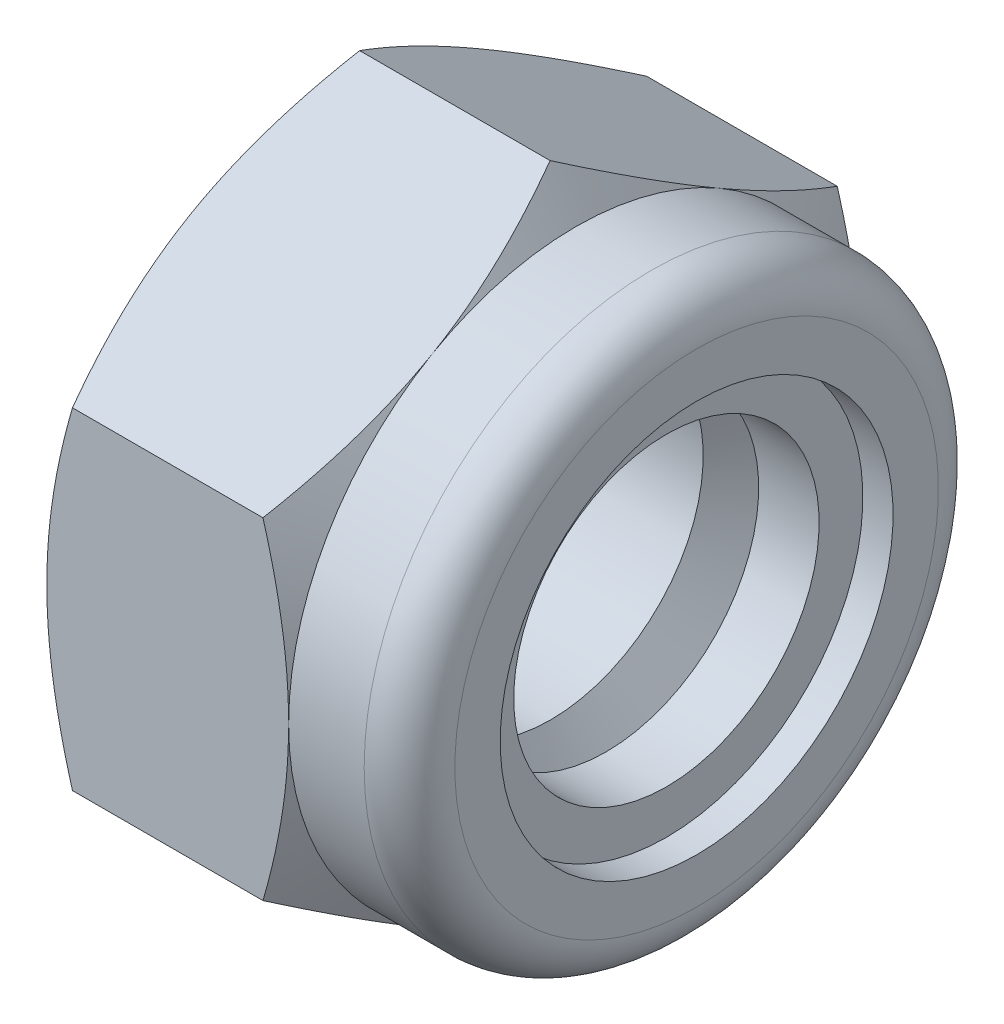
from build123d import *

# Parameters (mm, degrees)
SCHNITT_LINEAR_AUSTRAGEN1_DEPTH      = 13
SCHNITT_LINEAR_AUSTRAGEN1_DEPTH_BACK = 13
SKIZZE2_W                            = 38
SKIZZE2_H                            = 38


with BuildPart() as part:
    # Skizze1 → Rotation1 (revolve)
    with BuildSketch(Plane.XY):
        with BuildLine():
            Line((0, 6.5), (0.83542584, 5.053))
            Line((0.83542584, 5.053), (7.16457416, 5.053))
            Line((7.16457416, 5.053), (8, 6.5))
            Line((8, 6.5), (9, 6.5))
            Line((9, 6.5), (9, 5.053))
            Line((9, 5.053), (11, 5.053))
            Line((11, 5.053), (11, 6.5))
            Line((11, 6.5), (12, 6.5))
            Line((12, 6.5), (12, 8))
            ThreePointArc((12, 8), (11.560660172, 9.060660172), (10.5, 9.5))
            Line((10.5, 9.5), (8, 9.5))
            Line((8, 9.5), (5.257586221, 14.25))
            Line((5.257586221, 14.25), (2.742413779, 14.25))
            Line((2.742413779, 14.25), (0, 9.5))
            Line((0, 9.5), (0, 6.5))
        make_face()
    revolve(axis=Axis((12, 0, 0), (-1, 0, 0)))

    # Skizze2 → Schnitt-Linear austragen1 (cut, two sides: drawn at the far end of the back side and taken through both)
    with BuildSketch(Plane(origin=(0, 0, 0), x_dir=(0, 0, -1), z_dir=(1, 0, 0)).offset(-SCHNITT_LINEAR_AUSTRAGEN1_DEPTH_BACK)):
        Rectangle(SKIZZE2_W, SKIZZE2_H)
        Polygon((-9.5, 5.484827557), (-9.5, -5.484827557), (0, -10.969655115), (9.5, -5.484827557), (9.5, 5.484827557), (0, 10.969655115), align=None, mode=Mode.SUBTRACT)
    extrude(amount=SCHNITT_LINEAR_AUSTRAGEN1_DEPTH + SCHNITT_LINEAR_AUSTRAGEN1_DEPTH_BACK, mode=Mode.SUBTRACT)


solid = part.part
